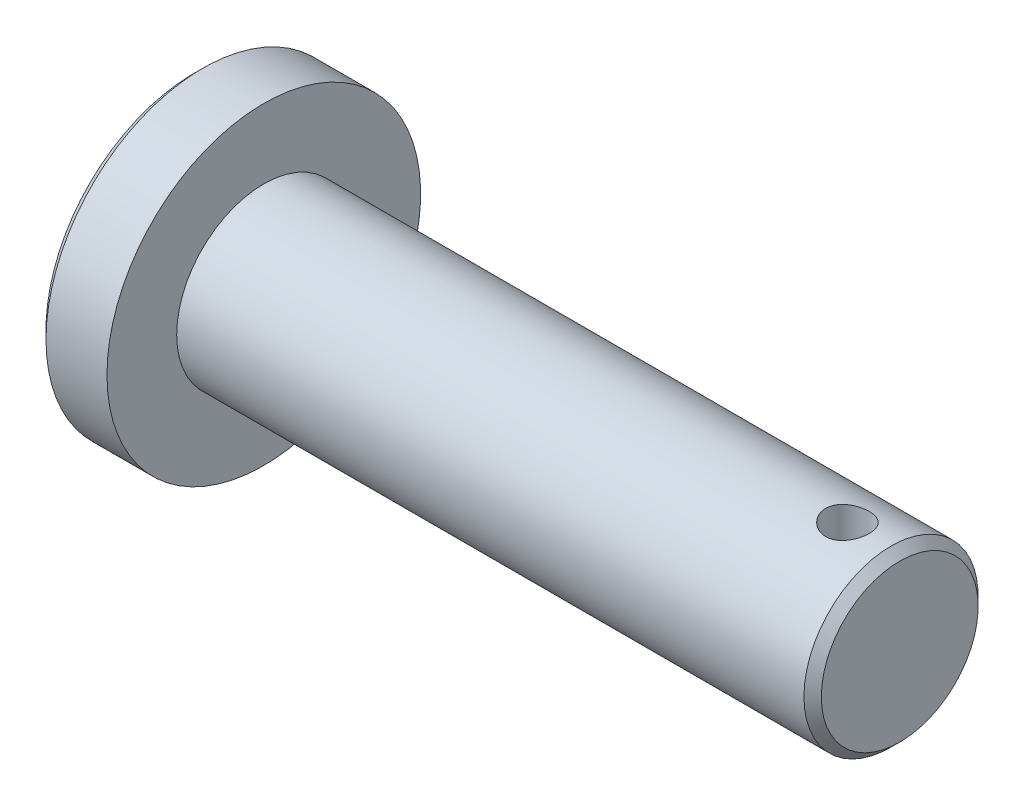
ISO-10303-21;
HEADER;
FILE_DESCRIPTION(('STEP AP214'),'2;1');
FILE_NAME('part.step','',(''),(''),'','','');
FILE_SCHEMA(('AUTOMOTIVE_DESIGN { 1 0 10303 214 1 1 1 1 }'));
ENDSEC;
DATA;
#1=APPLICATION_CONTEXT('core data for automotive mechanical design processes');
#2=APPLICATION_PROTOCOL_DEFINITION('international standard','automotive_design',2000,#1);
#3=PRODUCT_CONTEXT('',#1,'mechanical');
#4=PRODUCT('Part','Part','',(#3));
#5=PRODUCT_RELATED_PRODUCT_CATEGORY('part','',(#4));
#6=PRODUCT_DEFINITION_FORMATION('','',#4);
#7=PRODUCT_DEFINITION_CONTEXT('part definition',#1,'design');
#8=PRODUCT_DEFINITION('design','',#6,#7);
#9=PRODUCT_DEFINITION_SHAPE('','',#8);
#10=(LENGTH_UNIT() NAMED_UNIT(*) SI_UNIT(.MILLI.,.METRE.));
#11=(NAMED_UNIT(*) PLANE_ANGLE_UNIT() SI_UNIT($,.RADIAN.));
#12=(NAMED_UNIT(*) SI_UNIT($,.STERADIAN.) SOLID_ANGLE_UNIT());
#13=UNCERTAINTY_MEASURE_WITH_UNIT(LENGTH_MEASURE(1.E-05),#10,'distance_accuracy_value','');
#14=(GEOMETRIC_REPRESENTATION_CONTEXT(3) GLOBAL_UNCERTAINTY_ASSIGNED_CONTEXT((#13)) GLOBAL_UNIT_ASSIGNED_CONTEXT((#10,
#11,#12)) REPRESENTATION_CONTEXT('',''));
#15=CARTESIAN_POINT('',(0.,0.,0.));
#16=DIRECTION('',(0.,0.,1.));
#17=DIRECTION('',(1.,0.,0.));
#18=AXIS2_PLACEMENT_3D('',#15,#16,#17);
#19=CARTESIAN_POINT('',(0.,0.,0.));
#20=DIRECTION('',(1.,0.,0.));
#21=DIRECTION('',(0.,0.,-1.));
#22=AXIS2_PLACEMENT_3D('',#19,#20,#21);
#23=PLANE('',#22);
#24=CARTESIAN_POINT('',(0.,0.,0.));
#25=DIRECTION('',(1.,0.,0.));
#26=DIRECTION('',(0.,0.,-1.));
#27=AXIS2_PLACEMENT_3D('',#24,#25,#26);
#28=CIRCLE('',#27,17.);
#29=CARTESIAN_POINT('',(0.,0.,-17.));
#30=VERTEX_POINT('',#29);
#31=EDGE_CURVE('E37',#30,#30,#28,.F.);
#32=ORIENTED_EDGE('',*,*,#31,.T.);
#33=EDGE_LOOP('',(#32));
#34=FACE_BOUND('',#33,.T.);
#35=ADVANCED_FACE('F31',(#34),#23,.F.);
#36=CARTESIAN_POINT('',(-47.0052552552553,0.,0.));
#37=DIRECTION('',(-1.,0.,0.));
#38=DIRECTION('',(0.,0.,1.));
#39=AXIS2_PLACEMENT_3D('',#36,#37,#38);
#40=CYLINDRICAL_SURFACE('',#39,18.);
#41=CARTESIAN_POINT('',(1.,0.,0.));
#42=DIRECTION('',(1.,0.,0.));
#43=DIRECTION('',(0.,0.,-1.));
#44=AXIS2_PLACEMENT_3D('',#41,#42,#43);
#45=CIRCLE('',#44,18.);
#46=CARTESIAN_POINT('',(1.,0.,-18.));
#47=VERTEX_POINT('',#46);
#48=EDGE_CURVE('E10',#47,#47,#45,.T.);
#49=ORIENTED_EDGE('',*,*,#48,.T.);
#50=EDGE_LOOP('',(#49));
#51=FACE_BOUND('',#50,.T.);
#52=CARTESIAN_POINT('',(8.,0.,0.));
#53=DIRECTION('',(-1.,0.,0.));
#54=DIRECTION('',(0.,0.,1.));
#55=AXIS2_PLACEMENT_3D('',#52,#53,#54);
#56=CIRCLE('',#55,18.);
#57=CARTESIAN_POINT('',(8.,0.,18.));
#58=VERTEX_POINT('',#57);
#59=EDGE_CURVE('E50',#58,#58,#56,.T.);
#60=ORIENTED_EDGE('',*,*,#59,.T.);
#61=EDGE_LOOP('',(#60));
#62=FACE_BOUND('',#61,.T.);
#63=ADVANCED_FACE('F84',(#51,#62),#40,.T.);
#64=CARTESIAN_POINT('',(8.,18.,0.));
#65=DIRECTION('',(-1.,0.,0.));
#66=DIRECTION('',(0.,0.,1.));
#67=AXIS2_PLACEMENT_3D('',#64,#65,#66);
#68=PLANE('',#67);
#69=ORIENTED_EDGE('',*,*,#59,.F.);
#70=EDGE_LOOP('',(#69));
#71=FACE_BOUND('',#70,.T.);
#72=CARTESIAN_POINT('',(8.,0.,0.));
#73=DIRECTION('',(-1.,0.,0.));
#74=DIRECTION('',(0.,0.,1.));
#75=AXIS2_PLACEMENT_3D('',#72,#73,#74);
#76=CIRCLE('',#75,10.);
#77=CARTESIAN_POINT('',(8.,0.,10.));
#78=VERTEX_POINT('',#77);
#79=EDGE_CURVE('E58',#78,#78,#76,.T.);
#80=ORIENTED_EDGE('',*,*,#79,.T.);
#81=EDGE_LOOP('',(#80));
#82=FACE_BOUND('',#81,.T.);
#83=ADVANCED_FACE('F81',(#71,#82),#68,.F.);
#84=CARTESIAN_POINT('',(-47.0052552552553,0.,0.));
#85=DIRECTION('',(-1.,0.,0.));
#86=DIRECTION('',(0.,0.,1.));
#87=AXIS2_PLACEMENT_3D('',#84,#85,#86);
#88=CYLINDRICAL_SURFACE('',#87,10.);
#89=CARTESIAN_POINT('',(80.,0.,0.));
#90=DIRECTION('',(-1.,0.,0.));
#91=DIRECTION('',(0.,0.,1.));
#92=AXIS2_PLACEMENT_3D('',#89,#90,#91);
#93=CIRCLE('',#92,10.);
#94=CARTESIAN_POINT('',(80.,0.,10.));
#95=VERTEX_POINT('',#94);
#96=EDGE_CURVE('E45',#95,#95,#93,.T.);
#97=ORIENTED_EDGE('',*,*,#96,.T.);
#98=EDGE_LOOP('',(#97));
#99=FACE_BOUND('',#98,.T.);
#100=CARTESIAN_POINT('',(75.,-9.68245836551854,2.5));
#101=CARTESIAN_POINT('',(75.1380507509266,-9.6824610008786,2.49999607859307));
#102=CARTESIAN_POINT('',(75.2761448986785,-9.68544306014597,2.48852624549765));
#103=CARTESIAN_POINT('',(75.5483675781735,-9.69701861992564,2.44302312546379));
#104=CARTESIAN_POINT('',(75.6824937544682,-9.7056153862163,2.4089767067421));
#105=CARTESIAN_POINT('',(75.9428035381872,-9.7273872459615,2.31949119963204));
#106=CARTESIAN_POINT('',(76.0689971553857,-9.74055642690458,2.26407972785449));
#107=CARTESIAN_POINT('',(76.3103108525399,-9.76998192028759,2.13352114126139));
#108=CARTESIAN_POINT('',(76.4254304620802,-9.78623836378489,2.05837318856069));
#109=CARTESIAN_POINT('',(76.6438616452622,-9.82040716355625,1.88870842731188));
#110=CARTESIAN_POINT('',(76.74689360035,-9.83834597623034,1.79383688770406));
#111=CARTESIAN_POINT('',(76.9357613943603,-9.87362875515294,1.58818206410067));
#112=CARTESIAN_POINT('',(77.0215956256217,-9.89097266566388,1.47739729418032));
#113=CARTESIAN_POINT('',(77.1747754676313,-9.92340415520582,1.24114520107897));
#114=CARTESIAN_POINT('',(77.2418463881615,-9.93845687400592,1.11549457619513));
#115=CARTESIAN_POINT('',(77.3538096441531,-9.96430811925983,0.854263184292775));
#116=CARTESIAN_POINT('',(77.3987052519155,-9.97510727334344,0.718683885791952));
#117=CARTESIAN_POINT('',(77.4641478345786,-9.9910475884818,0.444358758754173));
#118=CARTESIAN_POINT('',(77.4851696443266,-9.99629893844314,0.305732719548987));
#119=CARTESIAN_POINT('',(77.5037583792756,-10.000935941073,0.0268288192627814));
#120=CARTESIAN_POINT('',(77.5013287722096,-10.000322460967,-0.113448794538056));
#121=CARTESIAN_POINT('',(77.4734251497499,-9.99338094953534,-0.388380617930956));
#122=CARTESIAN_POINT('',(77.4484636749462,-9.98718002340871,-0.523090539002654));
#123=CARTESIAN_POINT('',(77.3770287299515,-9.96990836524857,-0.786345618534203));
#124=CARTESIAN_POINT('',(77.3305541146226,-9.95883737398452,-0.914890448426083));
#125=CARTESIAN_POINT('',(77.216997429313,-9.93287509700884,-1.1635167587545));
#126=CARTESIAN_POINT('',(77.1497329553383,-9.91795019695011,-1.28351127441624));
#127=CARTESIAN_POINT('',(76.9966443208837,-9.88589903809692,-1.51068905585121));
#128=CARTESIAN_POINT('',(76.9108169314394,-9.8687723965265,-1.61787008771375));
#129=CARTESIAN_POINT('',(76.7202912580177,-9.83363713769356,-1.81943508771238));
#130=CARTESIAN_POINT('',(76.6151451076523,-9.81561719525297,-1.91339419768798));
#131=CARTESIAN_POINT('',(76.3904000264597,-9.78115043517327,-2.08244093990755));
#132=CARTESIAN_POINT('',(76.2708004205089,-9.76470369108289,-2.15752769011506));
#133=CARTESIAN_POINT('',(76.0197099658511,-9.73520496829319,-2.28697032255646));
#134=CARTESIAN_POINT('',(75.8881642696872,-9.72216983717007,-2.34122391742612));
#135=CARTESIAN_POINT('',(75.6174145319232,-9.70118640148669,-2.42671405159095));
#136=CARTESIAN_POINT('',(75.4782121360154,-9.69323700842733,-2.45795551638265));
#137=CARTESIAN_POINT('',(75.2000404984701,-9.68355356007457,-2.49582963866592));
#138=CARTESIAN_POINT('',(75.061162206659,-9.68166088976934,-2.50309047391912));
#139=CARTESIAN_POINT('',(74.7841780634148,-9.68387343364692,-2.49451699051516));
#140=CARTESIAN_POINT('',(74.6460721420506,-9.687978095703,-2.4786847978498));
#141=CARTESIAN_POINT('',(74.3768857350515,-9.70157081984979,-2.42492546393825));
#142=CARTESIAN_POINT('',(74.2457272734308,-9.71096970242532,-2.38736406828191));
#143=CARTESIAN_POINT('',(73.9915685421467,-9.73400718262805,-2.29161808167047));
#144=CARTESIAN_POINT('',(73.8685692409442,-9.74764628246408,-2.23343104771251));
#145=CARTESIAN_POINT('',(73.6315587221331,-9.77796137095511,-2.0967706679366));
#146=CARTESIAN_POINT('',(73.5177711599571,-9.79469168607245,-2.01792175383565));
#147=CARTESIAN_POINT('',(73.3048116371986,-9.82917083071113,-1.84265073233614));
#148=CARTESIAN_POINT('',(73.2056420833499,-9.84691982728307,-1.7462257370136));
#149=CARTESIAN_POINT('',(73.0221889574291,-9.88197403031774,-1.53565680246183));
#150=CARTESIAN_POINT('',(72.9383399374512,-9.8992570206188,-1.42112988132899));
#151=CARTESIAN_POINT('',(72.7910641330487,-9.93097216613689,-1.1792567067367));
#152=CARTESIAN_POINT('',(72.7276362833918,-9.94540447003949,-1.05191112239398));
#153=CARTESIAN_POINT('',(72.6235539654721,-9.96970115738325,-0.788895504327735));
#154=CARTESIAN_POINT('',(72.582735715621,-9.97959830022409,-0.653293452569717));
#155=CARTESIAN_POINT('',(72.5245396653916,-9.99385293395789,-0.376874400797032));
#156=CARTESIAN_POINT('',(72.507157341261,-9.99821149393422,-0.236058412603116));
#157=CARTESIAN_POINT('',(72.4965810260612,-10.0008542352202,0.0427088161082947));
#158=CARTESIAN_POINT('',(72.5027457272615,-9.99929947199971,0.180634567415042));
#159=CARTESIAN_POINT('',(72.5376195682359,-9.99064741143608,0.453418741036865));
#160=CARTESIAN_POINT('',(72.5663280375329,-9.98355027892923,0.588277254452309));
#161=CARTESIAN_POINT('',(72.6451305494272,-9.96463582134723,0.850427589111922));
#162=CARTESIAN_POINT('',(72.695108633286,-9.95284411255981,0.977756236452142));
#163=CARTESIAN_POINT('',(72.8149264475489,-9.92578222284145,1.22229263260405));
#164=CARTESIAN_POINT('',(72.8847686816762,-9.91051160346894,1.33949910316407));
#165=CARTESIAN_POINT('',(73.0442880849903,-9.87768124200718,1.56350482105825));
#166=CARTESIAN_POINT('',(73.1344003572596,-9.86007542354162,1.66998747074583));
#167=CARTESIAN_POINT('',(73.3310571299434,-9.82476622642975,1.86653755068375));
#168=CARTESIAN_POINT('',(73.4376057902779,-9.80706282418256,1.95660081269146));
#169=CARTESIAN_POINT('',(73.6665035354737,-9.77318689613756,2.11940506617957));
#170=CARTESIAN_POINT('',(73.7891103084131,-9.75704909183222,2.19179154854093));
#171=CARTESIAN_POINT('',(74.045138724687,-9.7285988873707,2.31481724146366));
#172=CARTESIAN_POINT('',(74.1785524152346,-9.71628370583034,2.36547227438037));
#173=CARTESIAN_POINT('',(74.4264425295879,-9.69879771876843,2.4360563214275));
#174=CARTESIAN_POINT('',(74.5397329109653,-9.69271657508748,2.45998292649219));
#175=CARTESIAN_POINT('',(74.7686721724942,-9.68454596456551,2.49195573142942));
#176=CARTESIAN_POINT('',(74.884320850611,-9.6824561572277,2.50000328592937));
#177=CARTESIAN_POINT('',(75.,-9.68245836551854,2.5));
#178=B_SPLINE_CURVE_WITH_KNOTS('',3,(#100,#101,#102,#103,#104,#105,#106,#107,#108,#109,#110,
#111,#112,#113,#114,#115,#116,#117,#118,#119,#120,#121,#122,#123,#124,#125,#126,#127,#128,#129,
#130,#131,#132,#133,#134,#135,#136,#137,#138,#139,#140,#141,#142,#143,#144,#145,#146,#147,#148,
#149,#150,#151,#152,#153,#154,#155,#156,#157,#158,#159,#160,#161,#162,#163,#164,#165,#166,#167,
#168,#169,#170,#171,#172,#173,#174,#175,#176,#177),.UNSPECIFIED.,.T.,.F.,(4,2,2,2,2,2,2,2,2,2,2,
2,2,2,2,2,2,2,2,2,2,2,2,2,2,2,2,2,2,2,2,2,2,2,2,2,2,2,4),(0.,0.413727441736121,
0.827695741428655,1.24113072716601,1.65458326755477,2.07623954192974,2.49793521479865,
2.92551496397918,3.3530315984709,3.77188750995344,4.19068148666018,4.60018262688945,
5.00970556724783,5.42292874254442,5.8362238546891,6.26070466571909,6.685205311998,
7.11176432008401,7.53823200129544,7.95343574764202,8.36860127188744,8.77697405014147,
9.1853952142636,9.60182845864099,10.0183301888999,10.4452533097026,10.872154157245,
11.2959207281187,11.7196054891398,12.131834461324,12.5440511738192,12.9540487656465,
13.3640980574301,13.7839709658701,14.2039503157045,14.6317647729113,15.0592672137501,
15.4059782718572,15.7526597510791),.UNSPECIFIED.);
#179=CARTESIAN_POINT('',(75.,-9.68245836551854,2.5));
#180=VERTEX_POINT('',#179);
#181=EDGE_CURVE('E51',#180,#180,#178,.T.);
#182=ORIENTED_EDGE('',*,*,#181,.T.);
#183=EDGE_LOOP('',(#182));
#184=FACE_BOUND('',#183,.T.);
#185=CARTESIAN_POINT('',(75.,9.68245836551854,2.5));
#186=CARTESIAN_POINT('',(74.8619492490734,9.6824610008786,2.49999607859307));
#187=CARTESIAN_POINT('',(74.7238551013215,9.68544306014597,2.48852624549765));
#188=CARTESIAN_POINT('',(74.4516324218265,9.69701861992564,2.44302312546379));
#189=CARTESIAN_POINT('',(74.3175062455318,9.7056153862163,2.4089767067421));
#190=CARTESIAN_POINT('',(74.0571964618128,9.7273872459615,2.31949119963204));
#191=CARTESIAN_POINT('',(73.9310028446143,9.74055642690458,2.26407972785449));
#192=CARTESIAN_POINT('',(73.6896891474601,9.76998192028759,2.13352114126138));
#193=CARTESIAN_POINT('',(73.5745695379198,9.78623836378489,2.05837318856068));
#194=CARTESIAN_POINT('',(73.3561383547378,9.82040716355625,1.88870842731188));
#195=CARTESIAN_POINT('',(73.25310639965,9.83834597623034,1.79383688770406));
#196=CARTESIAN_POINT('',(73.0642386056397,9.87362875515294,1.58818206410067));
#197=CARTESIAN_POINT('',(72.9784043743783,9.89097266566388,1.47739729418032));
#198=CARTESIAN_POINT('',(72.8252245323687,9.92340415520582,1.24114520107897));
#199=CARTESIAN_POINT('',(72.7581536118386,9.93845687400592,1.11549457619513));
#200=CARTESIAN_POINT('',(72.646190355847,9.96430811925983,0.854263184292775));
#201=CARTESIAN_POINT('',(72.6012947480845,9.97510727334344,0.718683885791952));
#202=CARTESIAN_POINT('',(72.5358521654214,9.9910475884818,0.444358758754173));
#203=CARTESIAN_POINT('',(72.5148303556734,9.99629893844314,0.305732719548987));
#204=CARTESIAN_POINT('',(72.4962416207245,10.000935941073,0.0268288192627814));
#205=CARTESIAN_POINT('',(72.4986712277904,10.000322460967,-0.113448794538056));
#206=CARTESIAN_POINT('',(72.5265748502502,9.99338094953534,-0.388380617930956));
#207=CARTESIAN_POINT('',(72.5515363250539,9.98718002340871,-0.523090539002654));
#208=CARTESIAN_POINT('',(72.6229712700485,9.96990836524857,-0.786345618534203));
#209=CARTESIAN_POINT('',(72.6694458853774,9.95883737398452,-0.914890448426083));
#210=CARTESIAN_POINT('',(72.7830025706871,9.93287509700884,-1.1635167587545));
#211=CARTESIAN_POINT('',(72.8502670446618,9.91795019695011,-1.28351127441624));
#212=CARTESIAN_POINT('',(73.0033556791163,9.88589903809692,-1.51068905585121));
#213=CARTESIAN_POINT('',(73.0891830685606,9.8687723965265,-1.61787008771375));
#214=CARTESIAN_POINT('',(73.2797087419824,9.83363713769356,-1.81943508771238));
#215=CARTESIAN_POINT('',(73.3848548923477,9.81561719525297,-1.91339419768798));
#216=CARTESIAN_POINT('',(73.6095999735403,9.78115043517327,-2.08244093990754));
#217=CARTESIAN_POINT('',(73.7291995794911,9.76470369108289,-2.15752769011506));
#218=CARTESIAN_POINT('',(73.9802900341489,9.73520496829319,-2.28697032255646));
#219=CARTESIAN_POINT('',(74.1118357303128,9.72216983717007,-2.34122391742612));
#220=CARTESIAN_POINT('',(74.3825854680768,9.70118640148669,-2.42671405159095));
#221=CARTESIAN_POINT('',(74.5217878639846,9.69323700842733,-2.45795551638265));
#222=CARTESIAN_POINT('',(74.7999595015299,9.68355356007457,-2.49582963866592));
#223=CARTESIAN_POINT('',(74.938837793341,9.68166088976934,-2.50309047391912));
#224=CARTESIAN_POINT('',(75.2158219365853,9.68387343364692,-2.49451699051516));
#225=CARTESIAN_POINT('',(75.3539278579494,9.687978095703,-2.4786847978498));
#226=CARTESIAN_POINT('',(75.6231142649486,9.7015708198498,-2.42492546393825));
#227=CARTESIAN_POINT('',(75.7542727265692,9.71096970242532,-2.3873640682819));
#228=CARTESIAN_POINT('',(76.0084314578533,9.73400718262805,-2.29161808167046));
#229=CARTESIAN_POINT('',(76.1314307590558,9.74764628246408,-2.2334310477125));
#230=CARTESIAN_POINT('',(76.3684412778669,9.77796137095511,-2.0967706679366));
#231=CARTESIAN_POINT('',(76.482228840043,9.79469168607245,-2.01792175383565));
#232=CARTESIAN_POINT('',(76.6951883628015,9.82917083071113,-1.84265073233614));
#233=CARTESIAN_POINT('',(76.7943579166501,9.84691982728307,-1.7462257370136));
#234=CARTESIAN_POINT('',(76.9778110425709,9.88197403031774,-1.53565680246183));
#235=CARTESIAN_POINT('',(77.0616600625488,9.8992570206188,-1.42112988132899));
#236=CARTESIAN_POINT('',(77.2089358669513,9.93097216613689,-1.1792567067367));
#237=CARTESIAN_POINT('',(77.2723637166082,9.94540447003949,-1.05191112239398));
#238=CARTESIAN_POINT('',(77.3764460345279,9.96970115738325,-0.788895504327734));
#239=CARTESIAN_POINT('',(77.4172642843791,9.97959830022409,-0.653293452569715));
#240=CARTESIAN_POINT('',(77.4754603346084,9.99385293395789,-0.37687440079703));
#241=CARTESIAN_POINT('',(77.492842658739,9.99821149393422,-0.236058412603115));
#242=CARTESIAN_POINT('',(77.5034189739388,10.0008542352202,0.0427088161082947));
#243=CARTESIAN_POINT('',(77.4972542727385,9.99929947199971,0.180634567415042));
#244=CARTESIAN_POINT('',(77.4623804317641,9.99064741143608,0.453418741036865));
#245=CARTESIAN_POINT('',(77.4336719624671,9.98355027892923,0.588277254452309));
#246=CARTESIAN_POINT('',(77.3548694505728,9.96463582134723,0.850427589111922));
#247=CARTESIAN_POINT('',(77.3048913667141,9.95284411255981,0.977756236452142));
#248=CARTESIAN_POINT('',(77.1850735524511,9.92578222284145,1.22229263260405));
#249=CARTESIAN_POINT('',(77.1152313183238,9.91051160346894,1.33949910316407));
#250=CARTESIAN_POINT('',(76.9557119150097,9.87768124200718,1.56350482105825));
#251=CARTESIAN_POINT('',(76.8655996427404,9.86007542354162,1.66998747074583));
#252=CARTESIAN_POINT('',(76.6689428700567,9.82476622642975,1.86653755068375));
#253=CARTESIAN_POINT('',(76.5623942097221,9.80706282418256,1.95660081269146));
#254=CARTESIAN_POINT('',(76.3334964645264,9.77318689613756,2.11940506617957));
#255=CARTESIAN_POINT('',(76.2108896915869,9.75704909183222,2.19179154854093));
#256=CARTESIAN_POINT('',(75.954861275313,9.7285988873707,2.31481724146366));
#257=CARTESIAN_POINT('',(75.8214475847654,9.71628370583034,2.36547227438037));
#258=CARTESIAN_POINT('',(75.5735574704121,9.69879771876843,2.4360563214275));
#259=CARTESIAN_POINT('',(75.4602670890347,9.69271657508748,2.45998292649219));
#260=CARTESIAN_POINT('',(75.2313278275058,9.68454596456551,2.49195573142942));
#261=CARTESIAN_POINT('',(75.115679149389,9.6824561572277,2.50000328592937));
#262=CARTESIAN_POINT('',(75.,9.68245836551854,2.5));
#263=B_SPLINE_CURVE_WITH_KNOTS('',3,(#185,#186,#187,#188,#189,#190,#191,#192,#193,#194,#195,
#196,#197,#198,#199,#200,#201,#202,#203,#204,#205,#206,#207,#208,#209,#210,#211,#212,#213,#214,
#215,#216,#217,#218,#219,#220,#221,#222,#223,#224,#225,#226,#227,#228,#229,#230,#231,#232,#233,
#234,#235,#236,#237,#238,#239,#240,#241,#242,#243,#244,#245,#246,#247,#248,#249,#250,#251,#252,
#253,#254,#255,#256,#257,#258,#259,#260,#261,#262),.UNSPECIFIED.,.T.,.F.,(4,2,2,2,2,2,2,2,2,2,2,
2,2,2,2,2,2,2,2,2,2,2,2,2,2,2,2,2,2,2,2,2,2,2,2,2,2,2,4),(0.,0.413727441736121,
0.827695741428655,1.24113072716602,1.65458326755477,2.07623954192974,2.49793521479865,
2.92551496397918,3.3530315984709,3.77188750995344,4.19068148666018,4.60018262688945,
5.00970556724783,5.42292874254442,5.8362238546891,6.26070466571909,6.68520531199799,
7.11176432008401,7.53823200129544,7.95343574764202,8.36860127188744,8.7769740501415,
9.1853952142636,9.60182845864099,10.0183301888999,10.4452533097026,10.872154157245,
11.2959207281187,11.7196054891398,12.131834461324,12.5440511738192,12.9540487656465,
13.3640980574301,13.7839709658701,14.2039503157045,14.6317647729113,15.0592672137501,
15.4059782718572,15.7526597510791),.UNSPECIFIED.);
#264=CARTESIAN_POINT('',(75.,9.68245836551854,2.5));
#265=VERTEX_POINT('',#264);
#266=EDGE_CURVE('E59',#265,#265,#263,.T.);
#267=ORIENTED_EDGE('',*,*,#266,.T.);
#268=EDGE_LOOP('',(#267));
#269=FACE_BOUND('',#268,.T.);
#270=ORIENTED_EDGE('',*,*,#79,.F.);
#271=EDGE_LOOP('',(#270));
#272=FACE_BOUND('',#271,.T.);
#273=ADVANCED_FACE('F63',(#99,#184,#269,#272),#88,.T.);
#274=CARTESIAN_POINT('',(81.,10.,0.));
#275=DIRECTION('',(-1.,0.,0.));
#276=DIRECTION('',(0.,0.,1.));
#277=AXIS2_PLACEMENT_3D('',#274,#275,#276);
#278=PLANE('',#277);
#279=CARTESIAN_POINT('',(81.,0.,0.));
#280=DIRECTION('',(-1.,0.,0.));
#281=DIRECTION('',(0.,0.,1.));
#282=AXIS2_PLACEMENT_3D('',#279,#280,#281);
#283=CIRCLE('',#282,8.99999999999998);
#284=CARTESIAN_POINT('',(81.,0.,8.99999999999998));
#285=VERTEX_POINT('',#284);
#286=EDGE_CURVE('E41',#285,#285,#283,.F.);
#287=ORIENTED_EDGE('',*,*,#286,.T.);
#288=EDGE_LOOP('',(#287));
#289=FACE_BOUND('',#288,.T.);
#290=ADVANCED_FACE('F72',(#289),#278,.F.);
#291=CARTESIAN_POINT('',(75.,-18.,0.));
#292=DIRECTION('',(0.,1.,0.));
#293=DIRECTION('',(0.,0.,1.));
#294=AXIS2_PLACEMENT_3D('',#291,#292,#293);
#295=CYLINDRICAL_SURFACE('',#294,2.5);
#296=ORIENTED_EDGE('',*,*,#266,.F.);
#297=EDGE_LOOP('',(#296));
#298=FACE_BOUND('',#297,.T.);
#299=ORIENTED_EDGE('',*,*,#181,.F.);
#300=EDGE_LOOP('',(#299));
#301=FACE_BOUND('',#300,.T.);
#302=ADVANCED_FACE('F67',(#298,#301),#295,.F.);
#303=CARTESIAN_POINT('',(80.,0.,0.));
#304=DIRECTION('',(-1.,0.,0.));
#305=DIRECTION('',(0.,0.,1.));
#306=AXIS2_PLACEMENT_3D('',#303,#304,#305);
#307=CONICAL_SURFACE('',#306,10.,0.785398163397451);
#308=ORIENTED_EDGE('',*,*,#286,.F.);
#309=EDGE_LOOP('',(#308));
#310=FACE_BOUND('',#309,.T.);
#311=ORIENTED_EDGE('',*,*,#96,.F.);
#312=EDGE_LOOP('',(#311));
#313=FACE_BOUND('',#312,.T.);
#314=ADVANCED_FACE('F71',(#310,#313),#307,.T.);
#315=CARTESIAN_POINT('',(0.,0.,0.));
#316=DIRECTION('',(1.,0.,0.));
#317=DIRECTION('',(0.,0.,-1.));
#318=AXIS2_PLACEMENT_3D('',#315,#316,#317);
#319=CONICAL_SURFACE('',#318,17.,0.785398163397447);
#320=ORIENTED_EDGE('',*,*,#48,.F.);
#321=EDGE_LOOP('',(#320));
#322=FACE_BOUND('',#321,.T.);
#323=ORIENTED_EDGE('',*,*,#31,.F.);
#324=EDGE_LOOP('',(#323));
#325=FACE_BOUND('',#324,.T.);
#326=ADVANCED_FACE('F123',(#322,#325),#319,.T.);
#327=CLOSED_SHELL('',(#35,#63,#83,#273,#290,#302,#314,#326));
#328=MANIFOLD_SOLID_BREP('B2',#327);
#329=ADVANCED_BREP_SHAPE_REPRESENTATION('',(#18,#328),#14);
#330=SHAPE_DEFINITION_REPRESENTATION(#9,#329);
ENDSEC;
END-ISO-10303-21;
